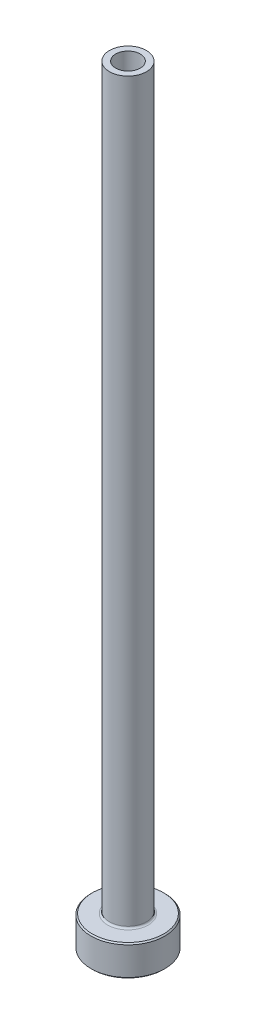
from build123d import *

# Parameters (mm, degrees)
FILLET1_R     = 0.3
CHAMFER1_SIZE = 0.2
CHAMFER3_SIZE = 0.5


with BuildPart() as part:
    # Sketch1 → Revolve1 (revolve)
    with BuildSketch(Plane.XY, mode=Mode.PRIVATE) as revolve1_sk:
        Polygon((-2, 125), (-3, 125), (-3, 5), (-6, 5), (-6, 0), (-2.25, 0), (-2.25, 68), (-2, 80), align=None)
    revolve(revolve1_sk.sketch.rotate(Axis((0, 92.187680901, 0), (0, -1, 0)), 270), axis=Axis((0, 92.187680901, 0), (0, -1, 0)))

    # Fillet1
    fillet1_edges = [part.edges().sort_by_distance(p)[0] for p in [
        (0, 5, -3),
    ]]
    fillet(fillet1_edges, radius=FILLET1_R)

    # Chamfer1
    chamfer1_edges = [part.edges().sort_by_distance(p)[0] for p in [
        (0, 0, -6),
        (0, 5, -6),
    ]]
    chamfer(chamfer1_edges, length=CHAMFER1_SIZE)

    # Chamfer3
    chamfer3_edges = [part.edges().sort_by_distance(p)[0] for p in [
        (0, 0, -2.25),
    ]]
    chamfer(chamfer3_edges, length=CHAMFER3_SIZE)


solid = part.part
